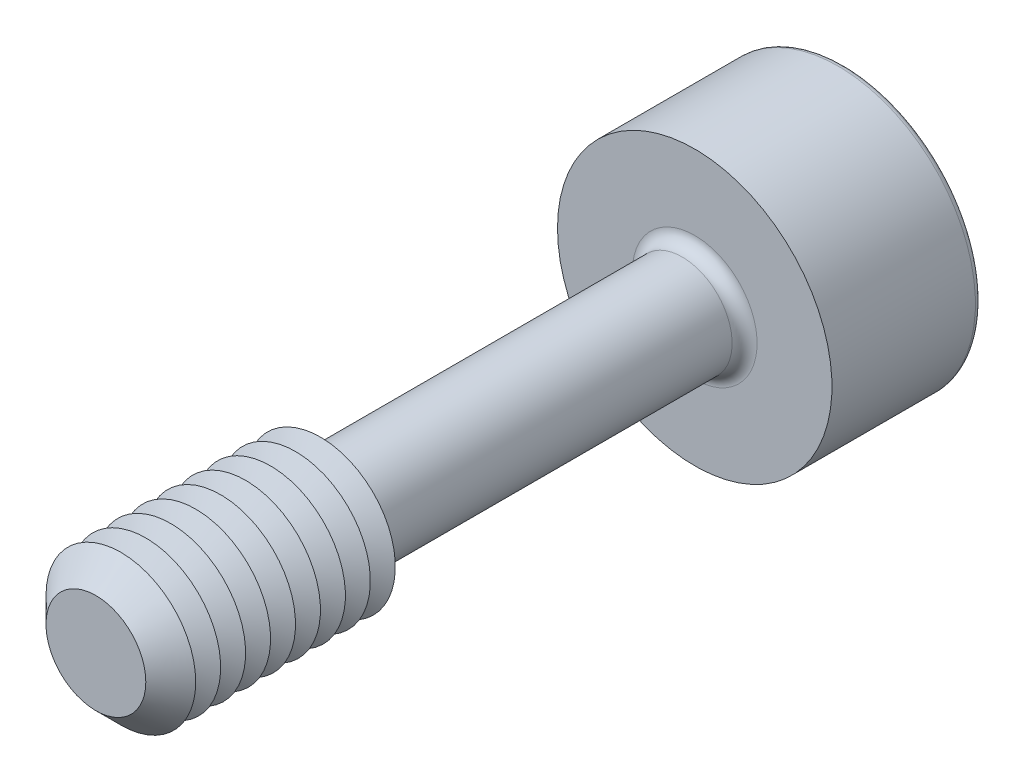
from build123d import *

# Parameters (mm, degrees)
SKETCH1_R       = 1
EXTRUDE1_DEPTH  = 6
CHAMFER1_SIZE   = 0.5
SKETCH3_R       = 2.75
EXTRUDE2_DEPTH  = 3
EXTRUDE3_DEPTH  = 2.5
FILLET1_R       = 0.25
FILLET2_R       = 0.125
LPATTERN1_COUNT = 8
LPATTERN1_PITCH = 0.5


with BuildPart() as part:
    # Sketch1 → Extrude1 (new, symmetric)
    with BuildSketch(Plane.XY):
        Circle(SKETCH1_R)
    extrude(amount=EXTRUDE1_DEPTH, both=True)

    # Sketch2 → Revolve1 (revolve)
    with BuildSketch(Plane(origin=(0, 0, 0), x_dir=(0, 0, -1), z_dir=(1, 0, 0))):
        Polygon((-6, 0), (-6, 1.5), (-1.5, 1.5), (-1.211324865, 1), (-1.211324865, 0), align=None)
    revolve(axis=Axis((0, 0, 1.211324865), (0, 0, 1)))

    # Chamfer1
    chamfer1_edges = [part.edges().sort_by_distance(p)[0] for p in [
        (0, -1.5, 6),
    ]]
    chamfer(chamfer1_edges, length=CHAMFER1_SIZE)

    # Sketch3 → Extrude2 (add)
    with BuildSketch(Plane(origin=(0, 0, -6), x_dir=(-1, 0, 0), z_dir=(0, 0, -1))):
        Circle(SKETCH3_R)
    extrude(amount=EXTRUDE2_DEPTH)

    # Sketch4 → Extrude3 (cut)
    with BuildSketch(Plane(origin=(-13.7, 0, -9), x_dir=(1, 0, 0), z_dir=(0, 0, 1))):
        Polygon((12.978312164, -1.25), (14.421687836, -1.25), (15.143375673, 0), (14.421687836, 1.25), (12.978312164, 1.25), (12.256624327, 0), align=None)
    extrude(amount=EXTRUDE3_DEPTH, mode=Mode.SUBTRACT)

    # Fillet1
    fillet1_edges = [part.edges().sort_by_distance(p)[0] for p in [
        (-1, 0, -6),
    ]]
    fillet(fillet1_edges, radius=FILLET1_R)

    # Fillet2
    fillet2_edges = [part.edges().sort_by_distance(p)[0] for p in [
        (2.75, 0, -9),
    ]]
    fillet(fillet2_edges, radius=FILLET2_R)

    # Sketch5 → Cut-Revolve1 (revolve, cut)
    with BuildSketch(Plane(origin=(0, 0, 0), x_dir=(0, 0, -1), z_dir=(1, 0, 0)), mode=Mode.PRIVATE) as cut_revolve1_sk:
        Polygon((6.5, 0), (6.5, -1.25), (5.778312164, 0), align=None)
    revolve(cut_revolve1_sk.sketch.rotate(Axis((0, 0, -5.778312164), (0, 0, -1)), 90), axis=Axis((0, 0, -5.778312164), (0, 0, -1)), mode=Mode.SUBTRACT)

    # Sketch7 → Cut-Revolve2 (revolve, cut)
    with BuildSketch(Plane(origin=(0, 0, 0), x_dir=(0, 0, -1), z_dir=(1, 0, 0)), mode=Mode.PRIVATE) as cut_revolve2_sk:
        Polygon((-1.5, 1.5), (-1.75, 1.066987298), (-2, 1.5), align=None)
    cut_revolve2 = revolve(cut_revolve2_sk.sketch.rotate(Axis((0, 0, -1.332048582), (0, 0, 1)), 90), axis=Axis((0, 0, -1.332048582), (0, 0, 1)), mode=Mode.SUBTRACT)

    # LPattern1: Cut-Revolve2 ×8
    with Locations(*[(0, 0, i * LPATTERN1_PITCH) for i in range(1, LPATTERN1_COUNT)]):
        add(cut_revolve2, mode=Mode.SUBTRACT)


solid = part.part
